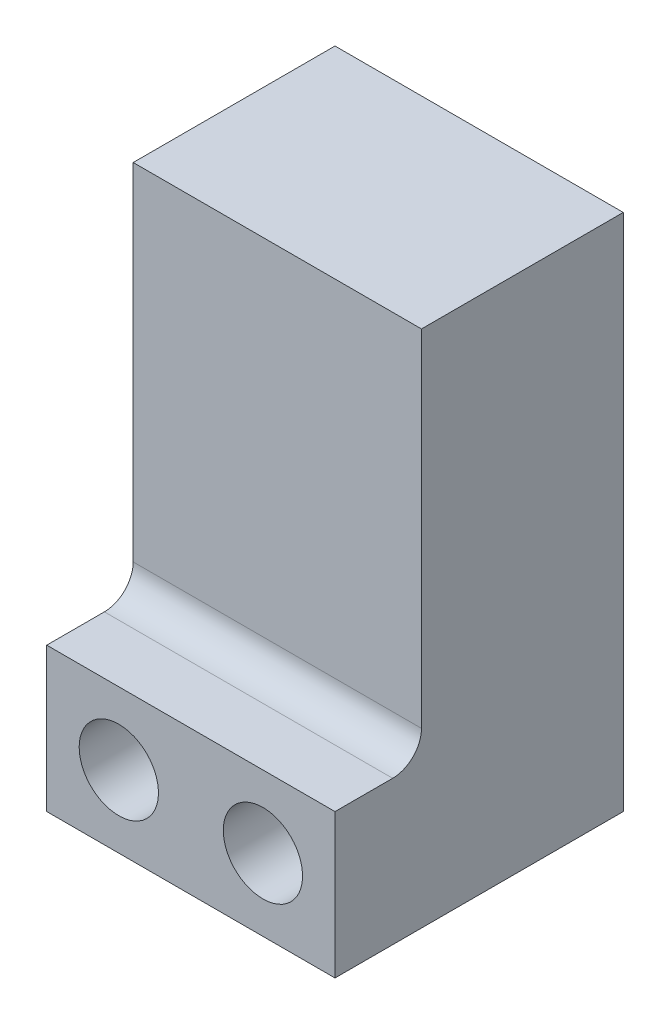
ISO-10303-21;
HEADER;
FILE_DESCRIPTION(('STEP AP214'),'2;1');
FILE_NAME('part.step','',(''),(''),'','','');
FILE_SCHEMA(('AUTOMOTIVE_DESIGN { 1 0 10303 214 1 1 1 1 }'));
ENDSEC;
DATA;
#1=APPLICATION_CONTEXT('core data for automotive mechanical design processes');
#2=APPLICATION_PROTOCOL_DEFINITION('international standard','automotive_design',2000,#1);
#3=PRODUCT_CONTEXT('',#1,'mechanical');
#4=PRODUCT('Part','Part','',(#3));
#5=PRODUCT_RELATED_PRODUCT_CATEGORY('part','',(#4));
#6=PRODUCT_DEFINITION_FORMATION('','',#4);
#7=PRODUCT_DEFINITION_CONTEXT('part definition',#1,'design');
#8=PRODUCT_DEFINITION('design','',#6,#7);
#9=PRODUCT_DEFINITION_SHAPE('','',#8);
#10=(LENGTH_UNIT() NAMED_UNIT(*) SI_UNIT(.MILLI.,.METRE.));
#11=(NAMED_UNIT(*) PLANE_ANGLE_UNIT() SI_UNIT($,.RADIAN.));
#12=(NAMED_UNIT(*) SI_UNIT($,.STERADIAN.) SOLID_ANGLE_UNIT());
#13=UNCERTAINTY_MEASURE_WITH_UNIT(LENGTH_MEASURE(1.E-05),#10,'distance_accuracy_value','');
#14=(GEOMETRIC_REPRESENTATION_CONTEXT(3) GLOBAL_UNCERTAINTY_ASSIGNED_CONTEXT((#13)) GLOBAL_UNIT_ASSIGNED_CONTEXT((#10,
#11,#12)) REPRESENTATION_CONTEXT('',''));
#15=CARTESIAN_POINT('',(0.,0.,0.));
#16=DIRECTION('',(0.,0.,1.));
#17=DIRECTION('',(1.,0.,0.));
#18=AXIS2_PLACEMENT_3D('',#15,#16,#17);
#19=CARTESIAN_POINT('',(29.9311122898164,0.,20.));
#20=DIRECTION('',(1.,0.,0.));
#21=DIRECTION('',(0.,0.,-1.));
#22=AXIS2_PLACEMENT_3D('',#19,#20,#21);
#23=PLANE('',#22);
#24=CARTESIAN_POINT('',(29.9311122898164,12.,16.));
#25=DIRECTION('',(1.,0.,0.));
#26=DIRECTION('',(0.,0.,-1.));
#27=AXIS2_PLACEMENT_3D('',#24,#25,#26);
#28=CIRCLE('',#27,2.);
#29=CARTESIAN_POINT('',(29.9311122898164,10.,16.));
#30=VERTEX_POINT('',#29);
#31=CARTESIAN_POINT('',(29.9311122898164,12.,14.));
#32=VERTEX_POINT('',#31);
#33=EDGE_CURVE('E133',#30,#32,#28,.T.);
#34=ORIENTED_EDGE('',*,*,#33,.T.);
#35=DIRECTION('',(0.,1.,0.));
#36=VECTOR('',#35,1.);
#37=CARTESIAN_POINT('',(29.9311122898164,36.,14.));
#38=LINE('',#37,#36);
#39=CARTESIAN_POINT('',(29.9311122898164,36.,14.));
#40=VERTEX_POINT('',#39);
#41=EDGE_CURVE('E66',#32,#40,#38,.T.);
#42=ORIENTED_EDGE('',*,*,#41,.T.);
#43=DIRECTION('',(0.,0.,-1.));
#44=VECTOR('',#43,1.);
#45=CARTESIAN_POINT('',(29.9311122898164,36.,20.));
#46=LINE('',#45,#44);
#47=CARTESIAN_POINT('',(29.9311122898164,36.,0.));
#48=VERTEX_POINT('',#47);
#49=EDGE_CURVE('E59',#40,#48,#46,.T.);
#50=ORIENTED_EDGE('',*,*,#49,.T.);
#51=DIRECTION('',(0.,-1.,0.));
#52=VECTOR('',#51,1.);
#53=CARTESIAN_POINT('',(29.9311122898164,0.,0.));
#54=LINE('',#53,#52);
#55=CARTESIAN_POINT('',(29.9311122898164,0.,0.));
#56=VERTEX_POINT('',#55);
#57=EDGE_CURVE('E64',#48,#56,#54,.T.);
#58=ORIENTED_EDGE('',*,*,#57,.T.);
#59=DIRECTION('',(0.,0.,-1.));
#60=VECTOR('',#59,1.);
#61=CARTESIAN_POINT('',(29.9311122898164,0.,20.));
#62=LINE('',#61,#60);
#63=CARTESIAN_POINT('',(29.9311122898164,0.,20.));
#64=VERTEX_POINT('',#63);
#65=EDGE_CURVE('E11',#64,#56,#62,.T.);
#66=ORIENTED_EDGE('',*,*,#65,.F.);
#67=DIRECTION('',(0.,-1.,0.));
#68=VECTOR('',#67,1.);
#69=CARTESIAN_POINT('',(29.9311122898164,0.,20.));
#70=LINE('',#69,#68);
#71=CARTESIAN_POINT('',(29.9311122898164,10.,20.));
#72=VERTEX_POINT('',#71);
#73=EDGE_CURVE('E79',#72,#64,#70,.T.);
#74=ORIENTED_EDGE('',*,*,#73,.F.);
#75=DIRECTION('',(0.,0.,-1.));
#76=VECTOR('',#75,1.);
#77=CARTESIAN_POINT('',(29.9311122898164,10.,20.));
#78=LINE('',#77,#76);
#79=EDGE_CURVE('E30',#72,#30,#78,.T.);
#80=ORIENTED_EDGE('',*,*,#79,.T.);
#81=EDGE_LOOP('',(#34,#42,#50,#58,#66,#74,#80));
#82=FACE_BOUND('',#81,.T.);
#83=ADVANCED_FACE('F16',(#82),#23,.F.);
#84=CARTESIAN_POINT('',(29.9311122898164,0.,20.));
#85=DIRECTION('',(0.,1.,0.));
#86=DIRECTION('',(0.,0.,1.));
#87=AXIS2_PLACEMENT_3D('',#84,#85,#86);
#88=PLANE('',#87);
#89=DIRECTION('',(1.,0.,0.));
#90=VECTOR('',#89,1.);
#91=CARTESIAN_POINT('',(29.9311122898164,0.,0.));
#92=LINE('',#91,#90);
#93=CARTESIAN_POINT('',(49.9311122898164,0.,0.));
#94=VERTEX_POINT('',#93);
#95=EDGE_CURVE('E83',#56,#94,#92,.T.);
#96=ORIENTED_EDGE('',*,*,#95,.T.);
#97=DIRECTION('',(0.,0.,-1.));
#98=VECTOR('',#97,1.);
#99=CARTESIAN_POINT('',(49.9311122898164,0.,20.));
#100=LINE('',#99,#98);
#101=CARTESIAN_POINT('',(49.9311122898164,0.,20.));
#102=VERTEX_POINT('',#101);
#103=EDGE_CURVE('E23',#102,#94,#100,.T.);
#104=ORIENTED_EDGE('',*,*,#103,.F.);
#105=DIRECTION('',(1.,0.,0.));
#106=VECTOR('',#105,1.);
#107=CARTESIAN_POINT('',(29.9311122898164,0.,20.));
#108=LINE('',#107,#106);
#109=EDGE_CURVE('E39',#64,#102,#108,.T.);
#110=ORIENTED_EDGE('',*,*,#109,.F.);
#111=ORIENTED_EDGE('',*,*,#65,.T.);
#112=EDGE_LOOP('',(#96,#104,#110,#111));
#113=FACE_BOUND('',#112,.T.);
#114=ADVANCED_FACE('F100',(#113),#88,.F.);
#115=CARTESIAN_POINT('',(49.9311122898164,0.,20.));
#116=DIRECTION('',(-1.,0.,0.));
#117=DIRECTION('',(0.,0.,1.));
#118=AXIS2_PLACEMENT_3D('',#115,#116,#117);
#119=PLANE('',#118);
#120=DIRECTION('',(0.,0.,-1.));
#121=VECTOR('',#120,1.);
#122=CARTESIAN_POINT('',(49.9311122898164,36.,20.));
#123=LINE('',#122,#121);
#124=CARTESIAN_POINT('',(49.9311122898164,36.,14.));
#125=VERTEX_POINT('',#124);
#126=CARTESIAN_POINT('',(49.9311122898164,36.,0.));
#127=VERTEX_POINT('',#126);
#128=EDGE_CURVE('E69',#125,#127,#123,.T.);
#129=ORIENTED_EDGE('',*,*,#128,.F.);
#130=DIRECTION('',(0.,1.,0.));
#131=VECTOR('',#130,1.);
#132=CARTESIAN_POINT('',(49.9311122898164,36.,14.));
#133=LINE('',#132,#131);
#134=CARTESIAN_POINT('',(49.9311122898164,12.,14.));
#135=VERTEX_POINT('',#134);
#136=EDGE_CURVE('E123',#135,#125,#133,.T.);
#137=ORIENTED_EDGE('',*,*,#136,.F.);
#138=CARTESIAN_POINT('',(49.9311122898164,12.,16.));
#139=DIRECTION('',(1.,0.,0.));
#140=DIRECTION('',(0.,0.,-1.));
#141=AXIS2_PLACEMENT_3D('',#138,#139,#140);
#142=CIRCLE('',#141,2.);
#143=CARTESIAN_POINT('',(49.9311122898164,10.,16.));
#144=VERTEX_POINT('',#143);
#145=EDGE_CURVE('E126',#144,#135,#142,.T.);
#146=ORIENTED_EDGE('',*,*,#145,.F.);
#147=DIRECTION('',(0.,0.,-1.));
#148=VECTOR('',#147,1.);
#149=CARTESIAN_POINT('',(49.9311122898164,10.,20.));
#150=LINE('',#149,#148);
#151=CARTESIAN_POINT('',(49.9311122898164,10.,20.));
#152=VERTEX_POINT('',#151);
#153=EDGE_CURVE('E129',#152,#144,#150,.T.);
#154=ORIENTED_EDGE('',*,*,#153,.F.);
#155=DIRECTION('',(0.,1.,0.));
#156=VECTOR('',#155,1.);
#157=CARTESIAN_POINT('',(49.9311122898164,0.,20.));
#158=LINE('',#157,#156);
#159=EDGE_CURVE('E70',#102,#152,#158,.T.);
#160=ORIENTED_EDGE('',*,*,#159,.F.);
#161=ORIENTED_EDGE('',*,*,#103,.T.);
#162=DIRECTION('',(0.,1.,0.));
#163=VECTOR('',#162,1.);
#164=CARTESIAN_POINT('',(49.9311122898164,0.,0.));
#165=LINE('',#164,#163);
#166=EDGE_CURVE('E80',#94,#127,#165,.T.);
#167=ORIENTED_EDGE('',*,*,#166,.T.);
#168=EDGE_LOOP('',(#129,#137,#146,#154,#160,#161,#167));
#169=FACE_BOUND('',#168,.T.);
#170=ADVANCED_FACE('F97',(#169),#119,.F.);
#171=CARTESIAN_POINT('',(29.9311122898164,36.,20.));
#172=DIRECTION('',(0.,-1.,0.));
#173=DIRECTION('',(0.,0.,-1.));
#174=AXIS2_PLACEMENT_3D('',#171,#172,#173);
#175=PLANE('',#174);
#176=ORIENTED_EDGE('',*,*,#49,.F.);
#177=DIRECTION('',(1.,0.,0.));
#178=VECTOR('',#177,1.);
#179=CARTESIAN_POINT('',(29.9311122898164,36.,14.));
#180=LINE('',#179,#178);
#181=EDGE_CURVE('E113',#40,#125,#180,.T.);
#182=ORIENTED_EDGE('',*,*,#181,.T.);
#183=ORIENTED_EDGE('',*,*,#128,.T.);
#184=DIRECTION('',(-1.,0.,0.));
#185=VECTOR('',#184,1.);
#186=CARTESIAN_POINT('',(29.9311122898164,36.,0.));
#187=LINE('',#186,#185);
#188=EDGE_CURVE('E73',#127,#48,#187,.T.);
#189=ORIENTED_EDGE('',*,*,#188,.T.);
#190=EDGE_LOOP('',(#176,#182,#183,#189));
#191=FACE_BOUND('',#190,.T.);
#192=ADVANCED_FACE('F74',(#191),#175,.F.);
#193=CARTESIAN_POINT('',(0.,0.,20.));
#194=DIRECTION('',(0.,0.,-1.));
#195=DIRECTION('',(-1.,0.,0.));
#196=AXIS2_PLACEMENT_3D('',#193,#194,#195);
#197=PLANE('',#196);
#198=CARTESIAN_POINT('',(44.9311122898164,5.,20.));
#199=DIRECTION('',(0.,0.,-1.));
#200=DIRECTION('',(-1.,0.,0.));
#201=AXIS2_PLACEMENT_3D('',#198,#199,#200);
#202=CIRCLE('',#201,2.75);
#203=CARTESIAN_POINT('',(42.1811122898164,5.,20.));
#204=VERTEX_POINT('',#203);
#205=EDGE_CURVE('E107',#204,#204,#202,.T.);
#206=ORIENTED_EDGE('',*,*,#205,.T.);
#207=EDGE_LOOP('',(#206));
#208=FACE_BOUND('',#207,.T.);
#209=CARTESIAN_POINT('',(34.9311122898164,5.,20.));
#210=DIRECTION('',(0.,0.,-1.));
#211=DIRECTION('',(-1.,0.,0.));
#212=AXIS2_PLACEMENT_3D('',#209,#210,#211);
#213=CIRCLE('',#212,2.75);
#214=CARTESIAN_POINT('',(32.1811122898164,5.,20.));
#215=VERTEX_POINT('',#214);
#216=EDGE_CURVE('E84',#215,#215,#213,.T.);
#217=ORIENTED_EDGE('',*,*,#216,.T.);
#218=EDGE_LOOP('',(#217));
#219=FACE_BOUND('',#218,.T.);
#220=ORIENTED_EDGE('',*,*,#159,.T.);
#221=DIRECTION('',(1.,0.,0.));
#222=VECTOR('',#221,1.);
#223=CARTESIAN_POINT('',(29.9311122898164,10.,20.));
#224=LINE('',#223,#222);
#225=EDGE_CURVE('E114',#72,#152,#224,.T.);
#226=ORIENTED_EDGE('',*,*,#225,.F.);
#227=ORIENTED_EDGE('',*,*,#73,.T.);
#228=ORIENTED_EDGE('',*,*,#109,.T.);
#229=EDGE_LOOP('',(#220,#226,#227,#228));
#230=FACE_BOUND('',#229,.T.);
#231=ADVANCED_FACE('F155',(#208,#219,#230),#197,.F.);
#232=CARTESIAN_POINT('',(0.,0.,0.));
#233=DIRECTION('',(0.,0.,-1.));
#234=DIRECTION('',(-1.,0.,0.));
#235=AXIS2_PLACEMENT_3D('',#232,#233,#234);
#236=PLANE('',#235);
#237=CARTESIAN_POINT('',(44.9311122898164,5.,0.));
#238=DIRECTION('',(0.,0.,-1.));
#239=DIRECTION('',(-1.,0.,0.));
#240=AXIS2_PLACEMENT_3D('',#237,#238,#239);
#241=CIRCLE('',#240,2.75);
#242=CARTESIAN_POINT('',(42.1811122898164,5.,0.));
#243=VERTEX_POINT('',#242);
#244=EDGE_CURVE('E110',#243,#243,#241,.T.);
#245=ORIENTED_EDGE('',*,*,#244,.F.);
#246=EDGE_LOOP('',(#245));
#247=FACE_BOUND('',#246,.T.);
#248=CARTESIAN_POINT('',(34.9311122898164,5.,0.));
#249=DIRECTION('',(0.,0.,-1.));
#250=DIRECTION('',(-1.,0.,0.));
#251=AXIS2_PLACEMENT_3D('',#248,#249,#250);
#252=CIRCLE('',#251,2.75);
#253=CARTESIAN_POINT('',(32.1811122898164,5.,0.));
#254=VERTEX_POINT('',#253);
#255=EDGE_CURVE('E88',#254,#254,#252,.T.);
#256=ORIENTED_EDGE('',*,*,#255,.F.);
#257=EDGE_LOOP('',(#256));
#258=FACE_BOUND('',#257,.T.);
#259=ORIENTED_EDGE('',*,*,#57,.F.);
#260=ORIENTED_EDGE('',*,*,#188,.F.);
#261=ORIENTED_EDGE('',*,*,#166,.F.);
#262=ORIENTED_EDGE('',*,*,#95,.F.);
#263=EDGE_LOOP('',(#259,#260,#261,#262));
#264=FACE_BOUND('',#263,.T.);
#265=ADVANCED_FACE('F82',(#247,#258,#264),#236,.T.);
#266=CARTESIAN_POINT('',(34.9311122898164,5.,0.));
#267=DIRECTION('',(0.,0.,-1.));
#268=DIRECTION('',(-1.,0.,0.));
#269=AXIS2_PLACEMENT_3D('',#266,#267,#268);
#270=CYLINDRICAL_SURFACE('',#269,2.75);
#271=ORIENTED_EDGE('',*,*,#216,.F.);
#272=EDGE_LOOP('',(#271));
#273=FACE_BOUND('',#272,.T.);
#274=ORIENTED_EDGE('',*,*,#255,.T.);
#275=EDGE_LOOP('',(#274));
#276=FACE_BOUND('',#275,.T.);
#277=ADVANCED_FACE('F181',(#273,#276),#270,.F.);
#278=CARTESIAN_POINT('',(44.9311122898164,5.,0.));
#279=DIRECTION('',(0.,0.,-1.));
#280=DIRECTION('',(-1.,0.,0.));
#281=AXIS2_PLACEMENT_3D('',#278,#279,#280);
#282=CYLINDRICAL_SURFACE('',#281,2.75);
#283=ORIENTED_EDGE('',*,*,#205,.F.);
#284=EDGE_LOOP('',(#283));
#285=FACE_BOUND('',#284,.T.);
#286=ORIENTED_EDGE('',*,*,#244,.T.);
#287=EDGE_LOOP('',(#286));
#288=FACE_BOUND('',#287,.T.);
#289=ADVANCED_FACE('F187',(#285,#288),#282,.F.);
#290=CARTESIAN_POINT('',(29.9311122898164,36.,14.));
#291=DIRECTION('',(0.,0.,-1.));
#292=DIRECTION('',(0.,1.,0.));
#293=AXIS2_PLACEMENT_3D('',#290,#291,#292);
#294=PLANE('',#293);
#295=ORIENTED_EDGE('',*,*,#136,.T.);
#296=ORIENTED_EDGE('',*,*,#181,.F.);
#297=ORIENTED_EDGE('',*,*,#41,.F.);
#298=DIRECTION('',(1.,0.,0.));
#299=VECTOR('',#298,1.);
#300=CARTESIAN_POINT('',(29.9311122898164,12.,14.));
#301=LINE('',#300,#299);
#302=EDGE_CURVE('E119',#32,#135,#301,.T.);
#303=ORIENTED_EDGE('',*,*,#302,.T.);
#304=EDGE_LOOP('',(#295,#296,#297,#303));
#305=FACE_BOUND('',#304,.T.);
#306=ADVANCED_FACE('F152',(#305),#294,.F.);
#307=CARTESIAN_POINT('',(29.9311122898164,12.,16.));
#308=DIRECTION('',(1.,0.,0.));
#309=DIRECTION('',(0.,0.,-1.));
#310=AXIS2_PLACEMENT_3D('',#307,#308,#309);
#311=CYLINDRICAL_SURFACE('',#310,2.);
#312=ORIENTED_EDGE('',*,*,#145,.T.);
#313=ORIENTED_EDGE('',*,*,#302,.F.);
#314=ORIENTED_EDGE('',*,*,#33,.F.);
#315=DIRECTION('',(1.,0.,0.));
#316=VECTOR('',#315,1.);
#317=CARTESIAN_POINT('',(29.9311122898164,10.,16.));
#318=LINE('',#317,#316);
#319=EDGE_CURVE('E116',#30,#144,#318,.T.);
#320=ORIENTED_EDGE('',*,*,#319,.T.);
#321=EDGE_LOOP('',(#312,#313,#314,#320));
#322=FACE_BOUND('',#321,.T.);
#323=ADVANCED_FACE('F140',(#322),#311,.F.);
#324=CARTESIAN_POINT('',(29.9311122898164,10.,20.));
#325=DIRECTION('',(0.,-1.,0.));
#326=DIRECTION('',(0.,0.,-1.));
#327=AXIS2_PLACEMENT_3D('',#324,#325,#326);
#328=PLANE('',#327);
#329=ORIENTED_EDGE('',*,*,#153,.T.);
#330=ORIENTED_EDGE('',*,*,#319,.F.);
#331=ORIENTED_EDGE('',*,*,#79,.F.);
#332=ORIENTED_EDGE('',*,*,#225,.T.);
#333=EDGE_LOOP('',(#329,#330,#331,#332));
#334=FACE_BOUND('',#333,.T.);
#335=ADVANCED_FACE('F156',(#334),#328,.F.);
#336=CLOSED_SHELL('',(#83,#114,#170,#192,#231,#265,#277,#289,#306,#323,#335));
#337=MANIFOLD_SOLID_BREP('B1',#336);
#338=ADVANCED_BREP_SHAPE_REPRESENTATION('',(#18,#337),#14);
#339=SHAPE_DEFINITION_REPRESENTATION(#9,#338);
ENDSEC;
END-ISO-10303-21;
